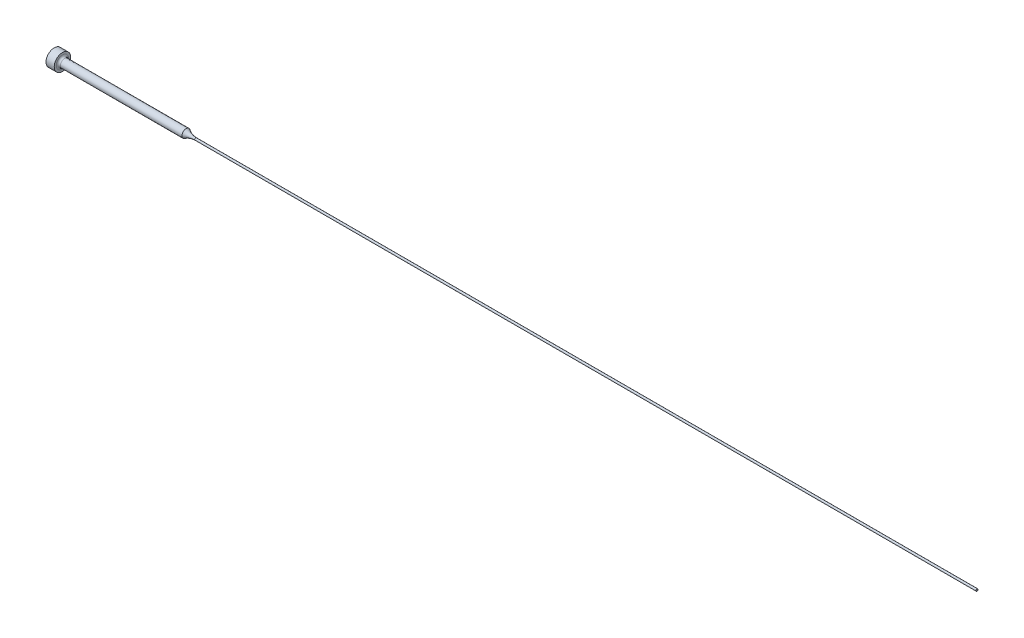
from build123d import *


with BuildPart() as part:
    # Sketch1 → Revolve1 (revolve)
    with BuildSketch(Plane.XY, mode=Mode.PRIVATE) as revolve1_sk:
        with BuildLine():
            Line((0, 0), (0, 3.175))
            Line((0, 3.175), (3.175, 3.175))
            Line((3.175, 3.175), (3.175, 2.38125))
            ThreePointArc((3.175, 2.38125), (3.407483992, 1.819983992), (3.96875, 1.5875))
            Line((3.96875, 1.5875), (50.8, 1.5875))
            ThreePointArc((50.8, 1.5875), (52.561542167, 0.696704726), (54.511519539, 0.38989))
            Line((54.511519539, 0.38989), (355.6, 0.38989))
            Line((355.6, 0.38989), (355.6, 0))
            Line((355.6, 0), (0, 0))
        make_face()
    revolve(revolve1_sk.sketch.rotate(Axis((355.6, 0, 0), (-1, 0, 0)), 180), axis=Axis((355.6, 0, 0), (-1, 0, 0)))


solid = part.part
